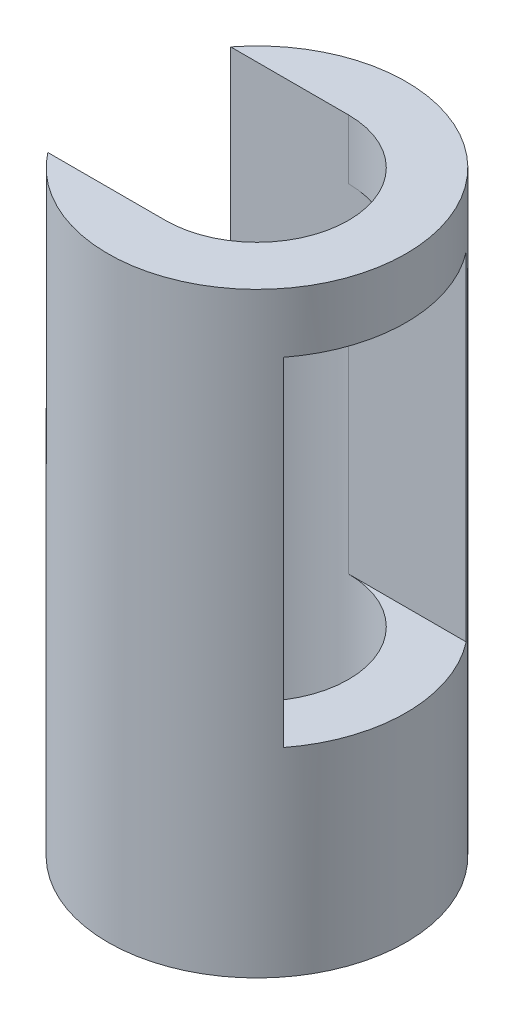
from build123d import *

# Parameters (mm, degrees)
SKETCH_1_R          = 7.5
SKETCH_1_R_2        = 4.6
EXTRUDE_1_DEPTH     = 10
EXTRUDE_2_DEPTH     = 20
EXTRUDE_START       = -3
EXTRUDE_3_DEPTH     = 3
EXTRUDE_4_DEPTH     = 20
SKETCH_8_R          = 4.6
CUT_EXTRUDE_1_DEPTH = 25
CUT_EXTRUDE_START   = -9
CUT_EXTRUDE_2_DEPTH = 9


with BuildPart() as part:
    # Sketch 1 → Extrude 1 (new body)
    with BuildSketch(Plane(origin=(0, 0, 0), x_dir=(1, 0, 0), z_dir=(0, 1, 0))):
        with Locations(Location((0, 0, 0), (0, 0, 270))):
            Circle(SKETCH_1_R)
        with Locations(Location((0, 0, 0), (0, 0, 270))):
            Circle(SKETCH_1_R_2, mode=Mode.SUBTRACT)
    extrude(amount=EXTRUDE_1_DEPTH)

    # Sketch 2 → Extrude 2 (add)
    with BuildSketch(Plane(origin=(0, 10, 0), x_dir=(1, 0, 0), z_dir=(0, 1, 0))):
        with BuildLine():
            Line((-5.923681, 4.6), (0, 4.6))
            Line((0, 4.6), (5.923681, 4.6))
            ThreePointArc((5.923681, 4.6), (0, 7.5), (-5.923681, 4.6))
        make_face()
        with BuildLine():
            Line((-5.923681, -4.6), (0, -4.6))
            Line((0, -4.6), (5.923681, -4.6))
            ThreePointArc((5.923681, -4.6), (0, -7.5), (-5.923681, -4.6))
        make_face()
    extrude(amount=EXTRUDE_2_DEPTH)

    # Sketch 3 → Extrude 3 (add)
    with BuildSketch(Plane(origin=(0, 30, 0), x_dir=(1, 0, 0), z_dir=(0, 1, 0)).offset(EXTRUDE_START)):
        with BuildLine():
            Line((5.923681, -4.6), (0, -4.6))
            ThreePointArc((0, -4.6), (4.6, 0), (0, 4.6))
            Line((0, 4.6), (5.923681, 4.6))
            ThreePointArc((5.923681, 4.6), (7.5, 0), (5.923681, -4.6))
        make_face()
    extrude(amount=EXTRUDE_3_DEPTH)

    # Sketch 5 → Extrude 4 (add)
    with BuildSketch(Plane(origin=(0, 10, 0), x_dir=(1, 0, 0), z_dir=(0, 1, 0))):
        with BuildLine():
            Line((-5.923681, 4.6), (0, 4.6))
            ThreePointArc((0, 4.6), (-4.6, 0), (0, -4.6))
            Line((0, -4.6), (-5.923681, -4.6))
            ThreePointArc((-5.923681, -4.6), (-7.5, 0), (-5.923681, 4.6))
        make_face()
    extrude(amount=EXTRUDE_4_DEPTH)

    # Sketch 8 → Cut-Extrude 1 (cut)
    with BuildSketch(Plane(origin=(-17.08518, -3.787693, 0), x_dir=(0, 0, -1), z_dir=(0.9762960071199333, 0.21643961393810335, 0))):
        with Locations(Location((0, 21.478512, 0), (0, 0, 270))):
            Circle(SKETCH_8_R)
    extrude(amount=CUT_EXTRUDE_1_DEPTH, mode=Mode.SUBTRACT)

    # Sketch 9 → Cut-Extrude 2 (cut)
    with BuildSketch(Plane(origin=(0, 30, 0), x_dir=(1, 0, 0), z_dir=(0, 1, 0)).offset(CUT_EXTRUDE_START)):
        with BuildLine():
            Line((0, 4.6), (-5.923681, 4.6))
            ThreePointArc((-5.923681, 4.6), (-7.5, 0), (-5.923681, -4.6))
            Line((-5.923681, -4.6), (0, -4.6))
            ThreePointArc((0, -4.6), (-4.6, 0), (0, 4.6))
        make_face()
    extrude(amount=CUT_EXTRUDE_2_DEPTH, mode=Mode.SUBTRACT)


solid = part.part
